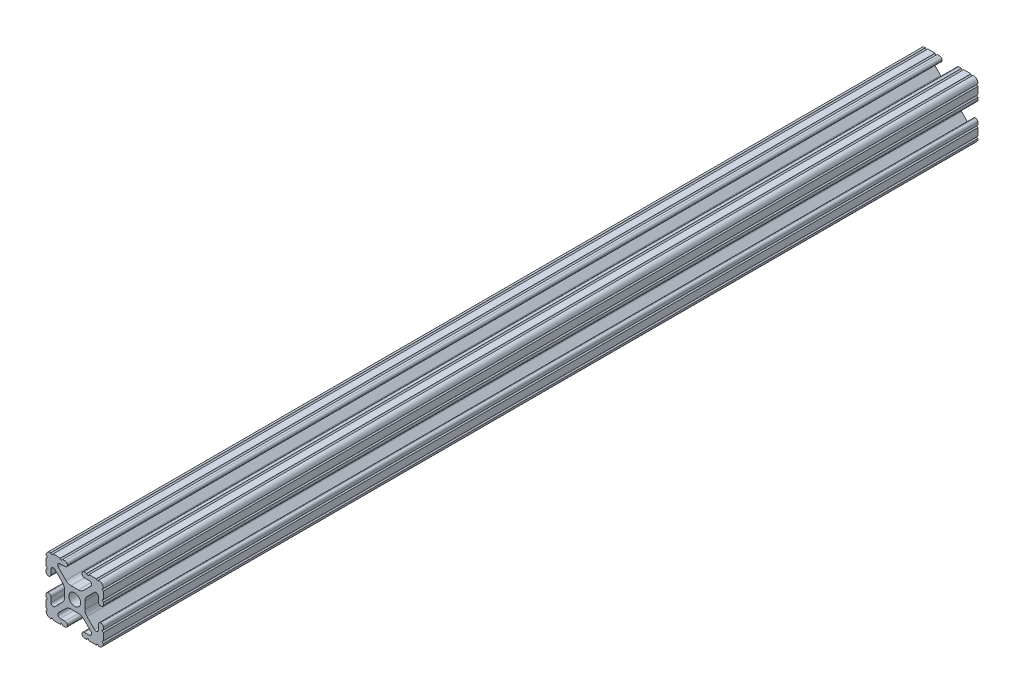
from build123d import *

# Parameters (mm, degrees)
SKETCH1_R      = 2.6035
EXTRUDE1_DEPTH = 387.35


with BuildPart() as part:
    # Sketch1 → Extrude1 (new body)
    with BuildSketch(Plane.XY):
        with BuildLine():
            Line((-7.207036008, 8.724370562), (-3.898272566, 5.423169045))
            ThreePointArc((-3.898272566, 5.423169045), (-2.869120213, 4.736787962), (-1.655778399, 4.4958))
            Line((-1.655778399, 4.4958), (1.655778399, 4.4958))
            ThreePointArc((1.655778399, 4.4958), (2.869120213, 4.736787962), (3.898272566, 5.423169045))
            Line((3.898272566, 5.423169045), (7.207036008, 8.724370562))
            ThreePointArc((7.207036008, 8.724370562), (7.432222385, 9.85140422), (6.476788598, 10.4902))
            Line((6.476788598, 10.4902), (4.287512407, 10.4902))
            ThreePointArc((4.287512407, 10.4902), (3.54574862, 10.79744862), (3.2385, 11.539212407))
            Line((3.2385, 11.539212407), (3.2385, 11.650987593))
            ThreePointArc((3.2385, 11.650987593), (3.54574862, 12.39275138), (4.287512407, 12.7))
            Line((4.287512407, 12.7), (5.317126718, 12.7))
            ThreePointArc((5.317126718, 12.7), (5.825126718, 12.192), (6.333126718, 12.7))
            Line((6.333126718, 12.7), (9.550443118, 12.7))
            ThreePointArc((9.550443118, 12.7), (10.058366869, 12.192000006), (10.566443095, 12.699847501))
            ThreePointArc((10.566443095, 12.699847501), (12.082537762, 12.08250727), (12.699846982, 10.566399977))
            ThreePointArc((12.699846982, 10.566399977), (12.192000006, 10.058323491), (12.7, 9.5504))
            Line((12.7, 9.5504), (12.7, 6.3330836))
            ThreePointArc((12.7, 6.3330836), (12.192, 5.8250836), (12.7, 5.3170836))
            Line((12.7, 5.3170836), (12.7, 4.287469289))
            ThreePointArc((12.7, 4.287469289), (12.39275138, 3.545705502), (11.650987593, 3.238456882))
            Line((11.650987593, 3.238456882), (11.539212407, 3.238456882))
            ThreePointArc((11.539212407, 3.238456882), (10.79744862, 3.545705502), (10.4902, 4.287469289))
            Line((10.4902, 4.287469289), (10.4902, 6.402089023))
            ThreePointArc((10.4902, 6.402089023), (9.856505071, 7.351067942), (8.737131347, 7.129408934))
            Line((8.737131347, 7.129408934), (5.441005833, 3.840816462))
            ThreePointArc((5.441005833, 3.840816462), (4.750877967, 2.809883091), (4.5085, 1.593185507))
            Line((4.5085, 1.593185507), (4.5085, -1.593185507))
            ThreePointArc((4.5085, -1.593185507), (4.750877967, -2.809883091), (5.441005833, -3.840816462))
            Line((5.441005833, -3.840816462), (8.737131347, -7.129408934))
            ThreePointArc((8.737131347, -7.129408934), (9.856505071, -7.351067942), (10.4902, -6.402089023))
            Line((10.4902, -6.402089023), (10.4902, -4.287469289))
            ThreePointArc((10.4902, -4.287469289), (10.79744862, -3.545705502), (11.539212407, -3.238456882))
            Line((11.539212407, -3.238456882), (11.650987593, -3.238456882))
            ThreePointArc((11.650987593, -3.238456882), (12.39275138, -3.545705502), (12.7, -4.287469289))
            Line((12.7, -4.287469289), (12.7, -5.3170836))
            ThreePointArc((12.7, -5.3170836), (12.192, -5.8250836), (12.7, -6.3330836))
            Line((12.7, -6.3330836), (12.7, -9.5504))
            ThreePointArc((12.7, -9.5504), (12.192000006, -10.058323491), (12.699846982, -10.566399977))
            ThreePointArc((12.699846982, -10.566399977), (12.082537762, -12.08250727), (10.566443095, -12.699847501))
            ThreePointArc((10.566443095, -12.699847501), (10.058366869, -12.192000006), (9.550443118, -12.7))
            Line((9.550443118, -12.7), (6.333126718, -12.7))
            ThreePointArc((6.333126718, -12.7), (5.825126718, -12.192), (5.317126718, -12.7))
            Line((5.317126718, -12.7), (4.287512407, -12.7))
            ThreePointArc((4.287512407, -12.7), (3.54574862, -12.39275138), (3.2385, -11.650987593))
            Line((3.2385, -11.650987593), (3.2385, -11.539212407))
            ThreePointArc((3.2385, -11.539212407), (3.54574862, -10.79744862), (4.287512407, -10.4902))
            Line((4.287512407, -10.4902), (6.416408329, -10.4902))
            ThreePointArc((6.416408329, -10.4902), (7.41473083, -9.822813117), (7.179650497, -8.645192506))
            Line((7.179650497, -8.645192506), (3.952270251, -5.423690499))
            ThreePointArc((3.952270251, -5.423690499), (2.922936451, -4.736929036), (1.709253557, -4.4958))
            Line((1.709253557, -4.4958), (-1.709253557, -4.4958))
            ThreePointArc((-1.709253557, -4.4958), (-2.922936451, -4.736929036), (-3.952270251, -5.423690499))
            Line((-3.952270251, -5.423690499), (-7.179650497, -8.645192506))
            ThreePointArc((-7.179650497, -8.645192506), (-7.41473083, -9.822813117), (-6.416408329, -10.4902))
            Line((-6.416408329, -10.4902), (-4.287512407, -10.4902))
            ThreePointArc((-4.287512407, -10.4902), (-3.54574862, -10.79744862), (-3.2385, -11.539212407))
            Line((-3.2385, -11.539212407), (-3.2385, -11.650987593))
            ThreePointArc((-3.2385, -11.650987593), (-3.54574862, -12.39275138), (-4.287512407, -12.7))
            Line((-4.287512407, -12.7), (-5.317126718, -12.7))
            ThreePointArc((-5.317126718, -12.7), (-5.825126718, -12.192), (-6.333126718, -12.7))
            Line((-6.333126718, -12.7), (-9.550443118, -12.7))
            ThreePointArc((-9.550443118, -12.7), (-10.058366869, -12.192000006), (-10.566443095, -12.699847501))
            ThreePointArc((-10.566443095, -12.699847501), (-12.082537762, -12.08250727), (-12.699846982, -10.566399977))
            ThreePointArc((-12.699846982, -10.566399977), (-12.192000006, -10.058323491), (-12.7, -9.5504))
            Line((-12.7, -9.5504), (-12.7, -6.3330836))
            ThreePointArc((-12.7, -6.3330836), (-12.192, -5.8250836), (-12.7, -5.3170836))
            Line((-12.7, -5.3170836), (-12.7, -4.287469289))
            ThreePointArc((-12.7, -4.287469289), (-12.39275138, -3.545705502), (-11.650987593, -3.238456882))
            Line((-11.650987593, -3.238456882), (-11.539212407, -3.238456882))
            ThreePointArc((-11.539212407, -3.238456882), (-10.79744862, -3.545705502), (-10.4902, -4.287469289))
            Line((-10.4902, -4.287469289), (-10.4902, -6.402089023))
            ThreePointArc((-10.4902, -6.402089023), (-9.856505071, -7.351067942), (-8.737131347, -7.129408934))
            Line((-8.737131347, -7.129408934), (-5.441005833, -3.840816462))
            ThreePointArc((-5.441005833, -3.840816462), (-4.750877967, -2.809883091), (-4.5085, -1.593185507))
            Line((-4.5085, -1.593185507), (-4.5085, 1.593185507))
            ThreePointArc((-4.5085, 1.593185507), (-4.750877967, 2.809883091), (-5.441005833, 3.840816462))
            Line((-5.441005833, 3.840816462), (-8.737131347, 7.129408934))
            ThreePointArc((-8.737131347, 7.129408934), (-9.856505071, 7.351067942), (-10.4902, 6.402089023))
            Line((-10.4902, 6.402089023), (-10.4902, 4.287469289))
            ThreePointArc((-10.4902, 4.287469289), (-10.79744862, 3.545705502), (-11.539212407, 3.238456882))
            Line((-11.539212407, 3.238456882), (-11.650987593, 3.238456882))
            ThreePointArc((-11.650987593, 3.238456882), (-12.39275138, 3.545705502), (-12.7, 4.287469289))
            Line((-12.7, 4.287469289), (-12.7, 5.3170836))
            ThreePointArc((-12.7, 5.3170836), (-12.192, 5.8250836), (-12.7, 6.3330836))
            Line((-12.7, 6.3330836), (-12.7, 9.5504))
            ThreePointArc((-12.7, 9.5504), (-12.192000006, 10.058323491), (-12.699846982, 10.566399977))
            ThreePointArc((-12.699846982, 10.566399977), (-12.082537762, 12.08250727), (-10.566443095, 12.699847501))
            ThreePointArc((-10.566443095, 12.699847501), (-10.058366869, 12.192000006), (-9.550443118, 12.7))
            Line((-9.550443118, 12.7), (-6.333126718, 12.7))
            ThreePointArc((-6.333126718, 12.7), (-5.825126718, 12.192), (-5.317126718, 12.7))
            Line((-5.317126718, 12.7), (-4.287512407, 12.7))
            ThreePointArc((-4.287512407, 12.7), (-3.54574862, 12.39275138), (-3.2385, 11.650987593))
            Line((-3.2385, 11.650987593), (-3.2385, 11.539212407))
            ThreePointArc((-3.2385, 11.539212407), (-3.54574862, 10.79744862), (-4.287512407, 10.4902))
            Line((-4.287512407, 10.4902), (-6.476788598, 10.4902))
            ThreePointArc((-6.476788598, 10.4902), (-7.432222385, 9.85140422), (-7.207036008, 8.724370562))
        make_face()
        Circle(SKETCH1_R, mode=Mode.SUBTRACT)
    extrude(amount=-EXTRUDE1_DEPTH)


solid = part.part
